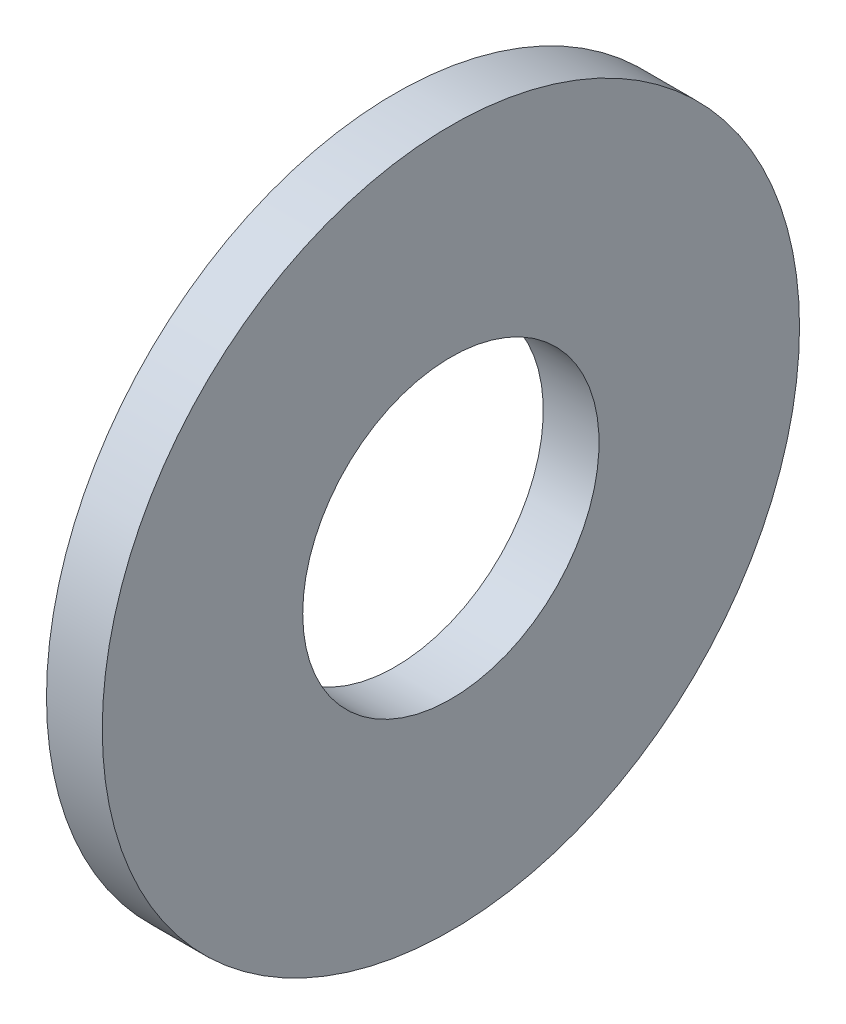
from build123d import *

# Parameters (mm, degrees)
SKETCH1_W = 0.8
SKETCH1_H = 2.875


with BuildPart() as part:
    # Sketch1 → Base-Revolve (revolve)
    with BuildSketch(Plane.XY, mode=Mode.PRIVATE) as base_revolve_sk:
        with Locations((-0.4, 3.5625)):
            Rectangle(SKETCH1_W, SKETCH1_H)
    revolve(base_revolve_sk.sketch.rotate(Axis((-34.925, 0, 0), (1, 0, 0)), 90), axis=Axis((-34.925, 0, 0), (1, 0, 0)))


solid = part.part
